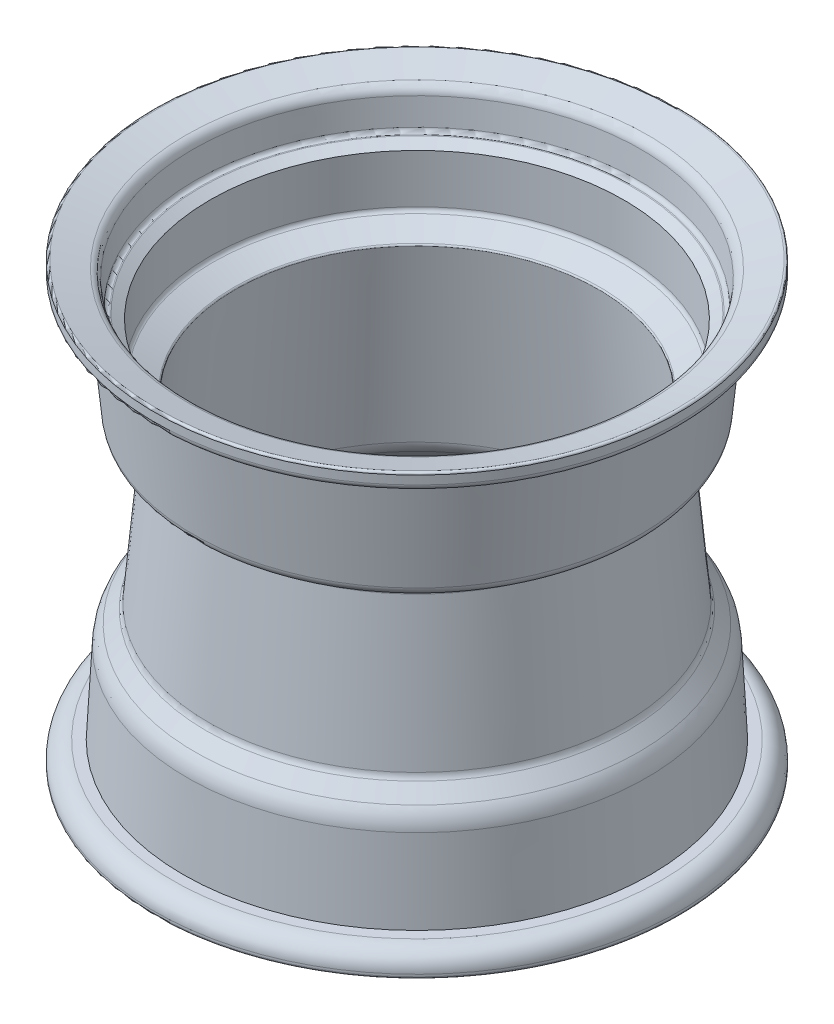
ISO-10303-21;
HEADER;
FILE_DESCRIPTION(('STEP AP214'),'2;1');
FILE_NAME('part.step','',(''),(''),'','','');
FILE_SCHEMA(('AUTOMOTIVE_DESIGN { 1 0 10303 214 1 1 1 1 }'));
ENDSEC;
DATA;
#1=APPLICATION_CONTEXT('core data for automotive mechanical design processes');
#2=APPLICATION_PROTOCOL_DEFINITION('international standard','automotive_design',2000,#1);
#3=PRODUCT_CONTEXT('',#1,'mechanical');
#4=PRODUCT('Part','Part','',(#3));
#5=PRODUCT_RELATED_PRODUCT_CATEGORY('part','',(#4));
#6=PRODUCT_DEFINITION_FORMATION('','',#4);
#7=PRODUCT_DEFINITION_CONTEXT('part definition',#1,'design');
#8=PRODUCT_DEFINITION('design','',#6,#7);
#9=PRODUCT_DEFINITION_SHAPE('','',#8);
#10=(LENGTH_UNIT() NAMED_UNIT(*) SI_UNIT(.MILLI.,.METRE.));
#11=(NAMED_UNIT(*) PLANE_ANGLE_UNIT() SI_UNIT($,.RADIAN.));
#12=(NAMED_UNIT(*) SI_UNIT($,.STERADIAN.) SOLID_ANGLE_UNIT());
#13=UNCERTAINTY_MEASURE_WITH_UNIT(LENGTH_MEASURE(1.E-05),#10,'distance_accuracy_value','');
#14=(GEOMETRIC_REPRESENTATION_CONTEXT(3) GLOBAL_UNCERTAINTY_ASSIGNED_CONTEXT((#13)) GLOBAL_UNIT_ASSIGNED_CONTEXT((#10,
#11,#12)) REPRESENTATION_CONTEXT('',''));
#15=CARTESIAN_POINT('',(0.,0.,0.));
#16=DIRECTION('',(0.,0.,1.));
#17=DIRECTION('',(1.,0.,0.));
#18=AXIS2_PLACEMENT_3D('',#15,#16,#17);
#19=CARTESIAN_POINT('',(1.50740531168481E-09,68.8072227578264,0.));
#20=DIRECTION('',(0.,1.,0.));
#21=DIRECTION('',(-1.,0.,0.));
#22=AXIS2_PLACEMENT_3D('',#19,#20,#21);
#23=TOROIDAL_SURFACE('',#22,173.191199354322,1.88128649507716);
#24=CARTESIAN_POINT('',(1.50738340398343E-09,70.4559709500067,0.));
#25=DIRECTION('',(0.,1.,0.));
#26=DIRECTION('',(-1.,0.,0.));
#27=AXIS2_PLACEMENT_3D('',#24,#25,#26);
#28=CIRCLE('',#27,172.285181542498);
#29=CARTESIAN_POINT('',(-172.285181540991,70.455970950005,0.));
#30=VERTEX_POINT('',#29);
#31=EDGE_CURVE('E10',#30,#30,#28,.T.);
#32=ORIENTED_EDGE('',*,*,#31,.T.);
#33=EDGE_LOOP('',(#32));
#34=FACE_BOUND('',#33,.T.);
#35=CARTESIAN_POINT('',(1.50739990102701E-09,68.8253299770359,0.));
#36=DIRECTION('',(0.,1.,0.));
#37=DIRECTION('',(-1.,0.,0.));
#38=AXIS2_PLACEMENT_3D('',#35,#36,#37);
#39=CIRCLE('',#38,171.310000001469);
#40=CARTESIAN_POINT('',(-171.309999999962,68.8253299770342,0.));
#41=VERTEX_POINT('',#40);
#42=EDGE_CURVE('E157',#41,#41,#39,.T.);
#43=ORIENTED_EDGE('',*,*,#42,.F.);
#44=EDGE_LOOP('',(#43));
#45=FACE_BOUND('',#44,.T.);
#46=ADVANCED_FACE('F36',(#34,#45),#23,.T.);
#47=CARTESIAN_POINT('',(1.50738340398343E-09,70.4559709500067,0.));
#48=DIRECTION('',(0.,1.,0.));
#49=DIRECTION('',(-1.,0.,0.));
#50=AXIS2_PLACEMENT_3D('',#47,#48,#49);
#51=CONICAL_SURFACE('',#50,172.285181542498,1.11221949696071);
#52=CARTESIAN_POINT('',(1.50728239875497E-09,80.4397758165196,0.));
#53=DIRECTION('',(0.,1.,0.));
#54=DIRECTION('',(-1.,0.,0.));
#55=AXIS2_PLACEMENT_3D('',#52,#53,#54);
#56=CIRCLE('',#55,192.508515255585);
#57=CARTESIAN_POINT('',(-192.508515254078,80.4397758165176,0.));
#58=VERTEX_POINT('',#57);
#59=EDGE_CURVE('E42',#58,#58,#56,.T.);
#60=ORIENTED_EDGE('',*,*,#59,.T.);
#61=EDGE_LOOP('',(#60));
#62=FACE_BOUND('',#61,.T.);
#63=ORIENTED_EDGE('',*,*,#31,.F.);
#64=EDGE_LOOP('',(#63));
#65=FACE_BOUND('',#64,.T.);
#66=ADVANCED_FACE('F165',(#62,#65),#51,.F.);
#67=CARTESIAN_POINT('',(1.50723877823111E-09,84.336060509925,0.));
#68=DIRECTION('',(0.,1.,0.));
#69=DIRECTION('',(-1.,0.,0.));
#70=AXIS2_PLACEMENT_3D('',#67,#68,#69);
#71=TOROIDAL_SURFACE('',#70,190.585007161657,4.3452178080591);
#72=CARTESIAN_POINT('',(1.50724298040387E-09,84.336060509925,0.));
#73=DIRECTION('',(0.,1.,0.));
#74=DIRECTION('',(-1.,0.,0.));
#75=AXIS2_PLACEMENT_3D('',#72,#73,#74);
#76=CIRCLE('',#75,194.930224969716);
#77=CARTESIAN_POINT('',(-194.930224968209,84.3360605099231,0.));
#78=VERTEX_POINT('',#77);
#79=EDGE_CURVE('E46',#78,#78,#76,.T.);
#80=ORIENTED_EDGE('',*,*,#79,.T.);
#81=EDGE_LOOP('',(#80));
#82=FACE_BOUND('',#81,.T.);
#83=ORIENTED_EDGE('',*,*,#59,.F.);
#84=EDGE_LOOP('',(#83));
#85=FACE_BOUND('',#84,.T.);
#86=ADVANCED_FACE('F169',(#82,#85),#71,.F.);
#87=CARTESIAN_POINT('',(1.50582631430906E-09,224.365622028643,0.));
#88=DIRECTION('',(0.,1.,0.));
#89=DIRECTION('',(-1.,0.,0.));
#90=AXIS2_PLACEMENT_3D('',#87,#88,#89);
#91=CYLINDRICAL_SURFACE('',#90,194.930224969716);
#92=CARTESIAN_POINT('',(1.50677802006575E-09,130.294803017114,0.));
#93=DIRECTION('',(0.,1.,0.));
#94=DIRECTION('',(-1.,0.,0.));
#95=AXIS2_PLACEMENT_3D('',#92,#93,#94);
#96=CIRCLE('',#95,194.930224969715);
#97=CARTESIAN_POINT('',(-194.930224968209,130.294803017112,0.));
#98=VERTEX_POINT('',#97);
#99=EDGE_CURVE('E50',#98,#98,#96,.T.);
#100=ORIENTED_EDGE('',*,*,#99,.T.);
#101=EDGE_LOOP('',(#100));
#102=FACE_BOUND('',#101,.T.);
#103=ORIENTED_EDGE('',*,*,#79,.F.);
#104=EDGE_LOOP('',(#103));
#105=FACE_BOUND('',#104,.T.);
#106=ADVANCED_FACE('F173',(#102,#105),#91,.F.);
#107=CARTESIAN_POINT('',(1.50677802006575E-09,130.294803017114,0.));
#108=DIRECTION('',(0.,1.,0.));
#109=DIRECTION('',(-1.,0.,0.));
#110=AXIS2_PLACEMENT_3D('',#107,#108,#109);
#111=CONICAL_SURFACE('',#110,194.930224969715,1.01087031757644);
#112=CARTESIAN_POINT('',(1.50672112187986E-09,135.918872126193,0.));
#113=DIRECTION('',(0.,1.,0.));
#114=DIRECTION('',(-1.,0.,0.));
#115=AXIS2_PLACEMENT_3D('',#112,#113,#114);
#116=CIRCLE('',#115,203.902229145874);
#117=CARTESIAN_POINT('',(-203.902229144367,135.918872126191,0.));
#118=VERTEX_POINT('',#117);
#119=EDGE_CURVE('E55',#118,#118,#116,.T.);
#120=ORIENTED_EDGE('',*,*,#119,.T.);
#121=EDGE_LOOP('',(#120));
#122=FACE_BOUND('',#121,.T.);
#123=ORIENTED_EDGE('',*,*,#99,.F.);
#124=EDGE_LOOP('',(#123));
#125=FACE_BOUND('',#124,.T.);
#126=ADVANCED_FACE('F180',(#122,#125),#111,.F.);
#127=CARTESIAN_POINT('',(1.50673917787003E-09,134.560560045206,0.));
#128=DIRECTION('',(0.,1.,0.));
#129=DIRECTION('',(-1.,0.,0.));
#130=AXIS2_PLACEMENT_3D('',#127,#128,#129);
#131=TOROIDAL_SURFACE('',#130,204.753682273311,1.60311700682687);
#132=CARTESIAN_POINT('',(1.50671864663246E-09,136.163536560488,0.));
#133=DIRECTION('',(0.,1.,0.));
#134=DIRECTION('',(-1.,0.,0.));
#135=AXIS2_PLACEMENT_3D('',#132,#133,#134);
#136=CIRCLE('',#135,204.774905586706);
#137=CARTESIAN_POINT('',(-204.7749055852,136.163536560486,0.));
#138=VERTEX_POINT('',#137);
#139=EDGE_CURVE('E58',#138,#138,#136,.T.);
#140=ORIENTED_EDGE('',*,*,#139,.T.);
#141=EDGE_LOOP('',(#140));
#142=FACE_BOUND('',#141,.T.);
#143=ORIENTED_EDGE('',*,*,#119,.F.);
#144=EDGE_LOOP('',(#143));
#145=FACE_BOUND('',#144,.T.);
#146=ADVANCED_FACE('F184',(#142,#145),#131,.T.);
#147=CARTESIAN_POINT('',(1.5066836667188E-09,139.925779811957,0.));
#148=DIRECTION('',(0.,1.,0.));
#149=DIRECTION('',(-1.,0.,0.));
#150=AXIS2_PLACEMENT_3D('',#147,#148,#149);
#151=TOROIDAL_SURFACE('',#150,204.824717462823,3.76257299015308);
#152=CARTESIAN_POINT('',(1.50668420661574E-09,139.567740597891,0.));
#153=DIRECTION('',(0.,1.,0.));
#154=DIRECTION('',(-1.,0.,0.));
#155=AXIS2_PLACEMENT_3D('',#152,#153,#154);
#156=CIRCLE('',#155,208.570216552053);
#157=CARTESIAN_POINT('',(-208.570216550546,139.567740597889,0.));
#158=VERTEX_POINT('',#157);
#159=EDGE_CURVE('E61',#158,#158,#156,.T.);
#160=ORIENTED_EDGE('',*,*,#159,.T.);
#161=EDGE_LOOP('',(#160));
#162=FACE_BOUND('',#161,.T.);
#163=ORIENTED_EDGE('',*,*,#139,.F.);
#164=EDGE_LOOP('',(#163));
#165=FACE_BOUND('',#164,.T.);
#166=ADVANCED_FACE('F188',(#162,#165),#151,.F.);
#167=CARTESIAN_POINT('',(1.50668420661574E-09,139.567740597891,0.));
#168=DIRECTION('',(0.,1.,0.));
#169=DIRECTION('',(-1.,0.,0.));
#170=AXIS2_PLACEMENT_3D('',#167,#168,#169);
#171=CONICAL_SURFACE('',#170,208.570216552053,0.0953022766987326);
#172=CARTESIAN_POINT('',(1.50644019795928E-09,163.686638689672,0.));
#173=DIRECTION('',(0.,1.,0.));
#174=DIRECTION('',(-1.,0.,0.));
#175=AXIS2_PLACEMENT_3D('',#172,#173,#174);
#176=CIRCLE('',#175,210.875786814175);
#177=CARTESIAN_POINT('',(-210.875786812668,163.68663868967,0.));
#178=VERTEX_POINT('',#177);
#179=EDGE_CURVE('E64',#178,#178,#176,.T.);
#180=ORIENTED_EDGE('',*,*,#179,.T.);
#181=EDGE_LOOP('',(#180));
#182=FACE_BOUND('',#181,.T.);
#183=ORIENTED_EDGE('',*,*,#159,.F.);
#184=EDGE_LOOP('',(#183));
#185=FACE_BOUND('',#184,.T.);
#186=ADVANCED_FACE('F192',(#182,#185),#171,.F.);
#187=CARTESIAN_POINT('',(1.50643386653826E-09,162.791540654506,0.));
#188=DIRECTION('',(0.,1.,0.));
#189=DIRECTION('',(-1.,0.,0.));
#190=AXIS2_PLACEMENT_3D('',#187,#188,#189);
#191=TOROIDAL_SURFACE('',#190,220.239534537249,9.40643247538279);
#192=CARTESIAN_POINT('',(1.50635776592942E-09,171.834586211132,0.));
#193=DIRECTION('',(0.,1.,0.));
#194=DIRECTION('',(-1.,0.,0.));
#195=AXIS2_PLACEMENT_3D('',#192,#193,#194);
#196=CIRCLE('',#195,217.650268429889);
#197=CARTESIAN_POINT('',(-217.650268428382,171.83458621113,0.));
#198=VERTEX_POINT('',#197);
#199=EDGE_CURVE('E67',#198,#198,#196,.T.);
#200=ORIENTED_EDGE('',*,*,#199,.T.);
#201=EDGE_LOOP('',(#200));
#202=FACE_BOUND('',#201,.T.);
#203=ORIENTED_EDGE('',*,*,#179,.F.);
#204=EDGE_LOOP('',(#203));
#205=FACE_BOUND('',#204,.T.);
#206=ADVANCED_FACE('F196',(#202,#205),#191,.T.);
#207=CARTESIAN_POINT('',(1.50635776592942E-09,171.834586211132,0.));
#208=DIRECTION('',(0.,1.,0.));
#209=DIRECTION('',(-1.,0.,0.));
#210=AXIS2_PLACEMENT_3D('',#207,#208,#209);
#211=CONICAL_SURFACE('',#210,217.650268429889,1.29193049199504);
#212=CARTESIAN_POINT('',(1.50627949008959E-09,179.571717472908,0.));
#213=DIRECTION('',(0.,1.,0.));
#214=DIRECTION('',(-1.,0.,0.));
#215=AXIS2_PLACEMENT_3D('',#212,#213,#214);
#216=CIRCLE('',#215,244.672299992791);
#217=CARTESIAN_POINT('',(-244.672299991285,179.571717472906,0.));
#218=VERTEX_POINT('',#217);
#219=EDGE_CURVE('E70',#218,#218,#216,.T.);
#220=ORIENTED_EDGE('',*,*,#219,.T.);
#221=EDGE_LOOP('',(#220));
#222=FACE_BOUND('',#221,.T.);
#223=ORIENTED_EDGE('',*,*,#199,.F.);
#224=EDGE_LOOP('',(#223));
#225=FACE_BOUND('',#224,.T.);
#226=ADVANCED_FACE('F200',(#222,#225),#211,.F.);
#227=CARTESIAN_POINT('',(1.50629508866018E-09,177.763108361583,0.));
#228=DIRECTION('',(0.,1.,0.));
#229=DIRECTION('',(-1.,0.,0.));
#230=AXIS2_PLACEMENT_3D('',#227,#228,#229);
#231=TOROIDAL_SURFACE('',#230,245.190153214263,1.88128649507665);
#232=CARTESIAN_POINT('',(1.50629778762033E-09,177.763108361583,0.));
#233=DIRECTION('',(0.,1.,0.));
#234=DIRECTION('',(-1.,0.,0.));
#235=AXIS2_PLACEMENT_3D('',#232,#233,#234);
#236=CIRCLE('',#235,247.07143970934);
#237=CARTESIAN_POINT('',(-247.071439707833,177.763108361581,0.));
#238=VERTEX_POINT('',#237);
#239=EDGE_CURVE('E73',#238,#238,#236,.T.);
#240=ORIENTED_EDGE('',*,*,#239,.T.);
#241=EDGE_LOOP('',(#240));
#242=FACE_BOUND('',#241,.T.);
#243=ORIENTED_EDGE('',*,*,#219,.F.);
#244=EDGE_LOOP('',(#243));
#245=FACE_BOUND('',#244,.T.);
#246=ADVANCED_FACE('F204',(#242,#245),#231,.T.);
#247=CARTESIAN_POINT('',(1.50582631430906E-09,224.365622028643,0.));
#248=DIRECTION('',(0.,1.,0.));
#249=DIRECTION('',(-1.,0.,0.));
#250=AXIS2_PLACEMENT_3D('',#247,#248,#249);
#251=CYLINDRICAL_SURFACE('',#250,247.07143970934);
#252=CARTESIAN_POINT('',(1.5063793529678E-09,169.70082757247,0.));
#253=DIRECTION('',(0.,1.,0.));
#254=DIRECTION('',(-1.,0.,0.));
#255=AXIS2_PLACEMENT_3D('',#252,#253,#254);
#256=CIRCLE('',#255,247.07143970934);
#257=CARTESIAN_POINT('',(-247.071439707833,169.700827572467,0.));
#258=VERTEX_POINT('',#257);
#259=EDGE_CURVE('E76',#258,#258,#256,.T.);
#260=ORIENTED_EDGE('',*,*,#259,.T.);
#261=EDGE_LOOP('',(#260));
#262=FACE_BOUND('',#261,.T.);
#263=ORIENTED_EDGE('',*,*,#239,.F.);
#264=EDGE_LOOP('',(#263));
#265=FACE_BOUND('',#264,.T.);
#266=ADVANCED_FACE('F208',(#262,#265),#251,.T.);
#267=CARTESIAN_POINT('',(1.50637835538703E-09,169.700827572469,0.));
#268=DIRECTION('',(0.,1.,0.));
#269=DIRECTION('',(-1.,0.,0.));
#270=AXIS2_PLACEMENT_3D('',#267,#268,#269);
#271=TOROIDAL_SURFACE('',#270,241.42758022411,5.64385948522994);
#272=CARTESIAN_POINT('',(1.50643476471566E-09,164.223684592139,0.));
#273=DIRECTION('',(0.,1.,0.));
#274=DIRECTION('',(-1.,0.,0.));
#275=AXIS2_PLACEMENT_3D('',#272,#273,#274);
#276=CIRCLE('',#275,242.789216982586);
#277=CARTESIAN_POINT('',(-242.78921698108,164.223684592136,0.));
#278=VERTEX_POINT('',#277);
#279=EDGE_CURVE('E79',#278,#278,#276,.T.);
#280=ORIENTED_EDGE('',*,*,#279,.T.);
#281=EDGE_LOOP('',(#280));
#282=FACE_BOUND('',#281,.T.);
#283=ORIENTED_EDGE('',*,*,#259,.F.);
#284=EDGE_LOOP('',(#283));
#285=FACE_BOUND('',#284,.T.);
#286=ADVANCED_FACE('F212',(#282,#285),#271,.T.);
#287=CARTESIAN_POINT('',(1.50643476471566E-09,164.223684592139,0.));
#288=DIRECTION('',(0.,1.,0.));
#289=DIRECTION('',(-1.,0.,0.));
#290=AXIS2_PLACEMENT_3D('',#287,#288,#289);
#291=CONICAL_SURFACE('',#290,242.789216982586,1.32713247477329);
#292=CARTESIAN_POINT('',(1.50647625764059E-09,160.122339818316,0.));
#293=DIRECTION('',(0.,1.,0.));
#294=DIRECTION('',(-1.,0.,0.));
#295=AXIS2_PLACEMENT_3D('',#292,#293,#294);
#296=CIRCLE('',#295,226.291680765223);
#297=CARTESIAN_POINT('',(-226.291680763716,160.122339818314,0.));
#298=VERTEX_POINT('',#297);
#299=EDGE_CURVE('E82',#298,#298,#296,.T.);
#300=ORIENTED_EDGE('',*,*,#299,.T.);
#301=EDGE_LOOP('',(#300));
#302=FACE_BOUND('',#301,.T.);
#303=ORIENTED_EDGE('',*,*,#279,.F.);
#304=EDGE_LOOP('',(#303));
#305=FACE_BOUND('',#304,.T.);
#306=ADVANCED_FACE('F216',(#302,#305),#291,.T.);
#307=CARTESIAN_POINT('',(1.50657264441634E-09,150.993768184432,0.));
#308=DIRECTION('',(0.,1.,0.));
#309=DIRECTION('',(-1.,0.,0.));
#310=AXIS2_PLACEMENT_3D('',#307,#308,#309);
#311=TOROIDAL_SURFACE('',#310,228.561075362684,9.4064324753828);
#312=CARTESIAN_POINT('',(1.50655955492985E-09,151.888866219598,0.));
#313=DIRECTION('',(0.,1.,0.));
#314=DIRECTION('',(-1.,0.,0.));
#315=AXIS2_PLACEMENT_3D('',#312,#313,#314);
#316=CIRCLE('',#315,219.197327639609);
#317=CARTESIAN_POINT('',(-219.197327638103,151.888866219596,0.));
#318=VERTEX_POINT('',#317);
#319=EDGE_CURVE('E85',#318,#318,#316,.T.);
#320=ORIENTED_EDGE('',*,*,#319,.T.);
#321=EDGE_LOOP('',(#320));
#322=FACE_BOUND('',#321,.T.);
#323=ORIENTED_EDGE('',*,*,#299,.F.);
#324=EDGE_LOOP('',(#323));
#325=FACE_BOUND('',#324,.T.);
#326=ADVANCED_FACE('F220',(#322,#325),#311,.F.);
#327=CARTESIAN_POINT('',(1.50655955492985E-09,151.888866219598,0.));
#328=DIRECTION('',(0.,1.,0.));
#329=DIRECTION('',(-1.,0.,0.));
#330=AXIS2_PLACEMENT_3D('',#327,#328,#329);
#331=CONICAL_SURFACE('',#330,219.197327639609,0.0953022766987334);
#332=CARTESIAN_POINT('',(1.50749278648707E-09,59.6441190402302,0.));
#333=DIRECTION('',(0.,1.,0.));
#334=DIRECTION('',(-1.,0.,0.));
#335=AXIS2_PLACEMENT_3D('',#332,#333,#334);
#336=CIRCLE('',#335,210.379480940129);
#337=CARTESIAN_POINT('',(-210.379480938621,59.644119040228,0.));
#338=VERTEX_POINT('',#337);
#339=EDGE_CURVE('E88',#338,#338,#336,.T.);
#340=ORIENTED_EDGE('',*,*,#339,.T.);
#341=EDGE_LOOP('',(#340));
#342=FACE_BOUND('',#341,.T.);
#343=ORIENTED_EDGE('',*,*,#319,.F.);
#344=EDGE_LOOP('',(#343));
#345=FACE_BOUND('',#344,.T.);
#346=ADVANCED_FACE('F224',(#342,#345),#331,.T.);
#347=CARTESIAN_POINT('',(1.50748857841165E-09,60.5392170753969,0.));
#348=DIRECTION('',(0.,1.,0.));
#349=DIRECTION('',(-1.,0.,0.));
#350=AXIS2_PLACEMENT_3D('',#347,#348,#349);
#351=TOROIDAL_SURFACE('',#350,201.015733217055,9.40643247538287);
#352=CARTESIAN_POINT('',(1.50757116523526E-09,51.8968158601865,0.));
#353=DIRECTION('',(0.,1.,0.));
#354=DIRECTION('',(-1.,0.,0.));
#355=AXIS2_PLACEMENT_3D('',#352,#353,#354);
#356=CIRCLE('',#355,204.729205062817);
#357=CARTESIAN_POINT('',(-204.729205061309,51.8968158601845,0.));
#358=VERTEX_POINT('',#357);
#359=EDGE_CURVE('E91',#358,#358,#356,.T.);
#360=ORIENTED_EDGE('',*,*,#359,.T.);
#361=EDGE_LOOP('',(#360));
#362=FACE_BOUND('',#361,.T.);
#363=ORIENTED_EDGE('',*,*,#339,.F.);
#364=EDGE_LOOP('',(#363));
#365=FACE_BOUND('',#364,.T.);
#366=ADVANCED_FACE('F228',(#362,#365),#351,.T.);
#367=CARTESIAN_POINT('',(1.50757116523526E-09,51.8968158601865,0.));
#368=DIRECTION('',(0.,1.,0.));
#369=DIRECTION('',(-1.,0.,0.));
#370=AXIS2_PLACEMENT_3D('',#367,#368,#369);
#371=CONICAL_SURFACE('',#370,204.729205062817,1.16496788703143);
#372=CARTESIAN_POINT('',(1.50763793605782E-09,45.2968915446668,0.));
#373=DIRECTION('',(0.,1.,0.));
#374=DIRECTION('',(-1.,0.,0.));
#375=AXIS2_PLACEMENT_3D('',#372,#373,#374);
#376=CIRCLE('',#375,189.369133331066);
#377=CARTESIAN_POINT('',(-189.369133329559,45.2968915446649,0.));
#378=VERTEX_POINT('',#377);
#379=EDGE_CURVE('E94',#378,#378,#376,.T.);
#380=ORIENTED_EDGE('',*,*,#379,.T.);
#381=EDGE_LOOP('',(#380));
#382=FACE_BOUND('',#381,.T.);
#383=ORIENTED_EDGE('',*,*,#359,.F.);
#384=EDGE_LOOP('',(#383));
#385=FACE_BOUND('',#384,.T.);
#386=ADVANCED_FACE('F232',(#382,#385),#371,.T.);
#387=CARTESIAN_POINT('',(1.50771062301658E-09,36.6544903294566,0.));
#388=DIRECTION('',(0.,1.,0.));
#389=DIRECTION('',(-1.,0.,0.));
#390=AXIS2_PLACEMENT_3D('',#387,#388,#389);
#391=TOROIDAL_SURFACE('',#390,193.082605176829,9.40643247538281);
#392=CARTESIAN_POINT('',(1.50773386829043E-09,35.8145240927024,0.));
#393=DIRECTION('',(0.,1.,0.));
#394=DIRECTION('',(-1.,0.,0.));
#395=AXIS2_PLACEMENT_3D('',#392,#393,#394);
#396=CIRCLE('',#395,183.713750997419);
#397=CARTESIAN_POINT('',(-183.713750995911,35.8145240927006,0.));
#398=VERTEX_POINT('',#397);
#399=EDGE_CURVE('E97',#398,#398,#396,.T.);
#400=ORIENTED_EDGE('',*,*,#399,.T.);
#401=EDGE_LOOP('',(#400));
#402=FACE_BOUND('',#401,.T.);
#403=ORIENTED_EDGE('',*,*,#379,.F.);
#404=EDGE_LOOP('',(#403));
#405=FACE_BOUND('',#404,.T.);
#406=ADVANCED_FACE('F236',(#402,#405),#391,.F.);
#407=CARTESIAN_POINT('',(1.50773386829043E-09,35.8145240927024,0.));
#408=DIRECTION('',(0.,-1.,0.));
#409=DIRECTION('',(1.,0.,0.));
#410=AXIS2_PLACEMENT_3D('',#407,#408,#409);
#411=CONICAL_SURFACE('',#410,183.713750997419,0.0894161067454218);
#412=CARTESIAN_POINT('',(1.50911840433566E-09,-101.039160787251,0.));
#413=DIRECTION('',(0.,1.,0.));
#414=DIRECTION('',(-1.,0.,0.));
#415=AXIS2_PLACEMENT_3D('',#412,#413,#414);
#416=CIRCLE('',#415,195.983391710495);
#417=CARTESIAN_POINT('',(-195.983391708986,-101.039160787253,0.));
#418=VERTEX_POINT('',#417);
#419=EDGE_CURVE('E100',#418,#418,#416,.T.);
#420=ORIENTED_EDGE('',*,*,#419,.T.);
#421=EDGE_LOOP('',(#420));
#422=FACE_BOUND('',#421,.T.);
#423=ORIENTED_EDGE('',*,*,#399,.F.);
#424=EDGE_LOOP('',(#423));
#425=FACE_BOUND('',#424,.T.);
#426=ADVANCED_FACE('F240',(#422,#425),#411,.T.);
#427=CARTESIAN_POINT('',(1.50909840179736E-09,-100.199194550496,0.));
#428=DIRECTION('',(0.,1.,0.));
#429=DIRECTION('',(-1.,0.,0.));
#430=AXIS2_PLACEMENT_3D('',#427,#428,#429);
#431=TOROIDAL_SURFACE('',#430,205.352245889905,9.4064324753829);
#432=CARTESIAN_POINT('',(1.50917367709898E-09,-106.502565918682,0.));
#433=DIRECTION('',(0.,1.,0.));
#434=DIRECTION('',(-1.,0.,0.));
#435=AXIS2_PLACEMENT_3D('',#432,#433,#434);
#436=CIRCLE('',#435,198.370234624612);
#437=CARTESIAN_POINT('',(-198.370234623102,-106.502565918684,0.));
#438=VERTEX_POINT('',#437);
#439=EDGE_CURVE('E103',#438,#438,#436,.T.);
#440=ORIENTED_EDGE('',*,*,#439,.T.);
#441=EDGE_LOOP('',(#440));
#442=FACE_BOUND('',#441,.T.);
#443=ORIENTED_EDGE('',*,*,#419,.F.);
#444=EDGE_LOOP('',(#443));
#445=FACE_BOUND('',#444,.T.);
#446=ADVANCED_FACE('F244',(#442,#445),#431,.F.);
#447=CARTESIAN_POINT('',(1.50917367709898E-09,-106.502565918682,0.));
#448=DIRECTION('',(0.,-1.,0.));
#449=DIRECTION('',(1.,0.,0.));
#450=AXIS2_PLACEMENT_3D('',#447,#448,#449);
#451=CONICAL_SURFACE('',#450,198.370234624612,0.734360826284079);
#452=CARTESIAN_POINT('',(1.50929417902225E-09,-118.41351059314,0.));
#453=DIRECTION('',(0.,1.,0.));
#454=DIRECTION('',(-1.,0.,0.));
#455=AXIS2_PLACEMENT_3D('',#452,#453,#454);
#456=CIRCLE('',#455,209.123455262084);
#457=CARTESIAN_POINT('',(-209.123455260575,-118.413510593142,0.));
#458=VERTEX_POINT('',#457);
#459=EDGE_CURVE('E106',#458,#458,#456,.T.);
#460=ORIENTED_EDGE('',*,*,#459,.T.);
#461=EDGE_LOOP('',(#460));
#462=FACE_BOUND('',#461,.T.);
#463=ORIENTED_EDGE('',*,*,#439,.F.);
#464=EDGE_LOOP('',(#463));
#465=FACE_BOUND('',#464,.T.);
#466=ADVANCED_FACE('F248',(#462,#465),#451,.T.);
#467=CARTESIAN_POINT('',(1.50948697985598E-09,-137.323624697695,0.));
#468=DIRECTION('',(0.,1.,0.));
#469=DIRECTION('',(-1.,0.,0.));
#470=AXIS2_PLACEMENT_3D('',#467,#468,#469);
#471=TOROIDAL_SURFACE('',#470,188.177421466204,28.2192974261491);
#472=CARTESIAN_POINT('',(1.50947046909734E-09,-135.838803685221,0.));
#473=DIRECTION('',(0.,1.,0.));
#474=DIRECTION('',(-1.,0.,0.));
#475=AXIS2_PLACEMENT_3D('',#472,#473,#474);
#476=CIRCLE('',#475,216.357628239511);
#477=CARTESIAN_POINT('',(-216.357628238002,-135.838803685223,0.));
#478=VERTEX_POINT('',#477);
#479=EDGE_CURVE('E109',#478,#478,#476,.T.);
#480=ORIENTED_EDGE('',*,*,#479,.T.);
#481=EDGE_LOOP('',(#480));
#482=FACE_BOUND('',#481,.T.);
#483=ORIENTED_EDGE('',*,*,#459,.F.);
#484=EDGE_LOOP('',(#483));
#485=FACE_BOUND('',#484,.T.);
#486=ADVANCED_FACE('F252',(#482,#485),#471,.T.);
#487=CARTESIAN_POINT('',(1.50947046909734E-09,-135.838803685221,0.));
#488=DIRECTION('',(0.,-1.,0.));
#489=DIRECTION('',(1.,0.,0.));
#490=AXIS2_PLACEMENT_3D('',#487,#488,#489);
#491=CONICAL_SURFACE('',#490,216.357628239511,0.0526415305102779);
#492=CARTESIAN_POINT('',(1.51024851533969E-09,-212.744345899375,0.));
#493=DIRECTION('',(0.,1.,0.));
#494=DIRECTION('',(-1.,0.,0.));
#495=AXIS2_PLACEMENT_3D('',#492,#493,#494);
#496=CIRCLE('',#495,220.40979740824);
#497=CARTESIAN_POINT('',(-220.40979740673,-212.744345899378,0.));
#498=VERTEX_POINT('',#497);
#499=EDGE_CURVE('E112',#498,#498,#496,.T.);
#500=ORIENTED_EDGE('',*,*,#499,.T.);
#501=EDGE_LOOP('',(#500));
#502=FACE_BOUND('',#501,.T.);
#503=ORIENTED_EDGE('',*,*,#479,.F.);
#504=EDGE_LOOP('',(#503));
#505=FACE_BOUND('',#504,.T.);
#506=ADVANCED_FACE('F256',(#502,#505),#491,.T.);
#507=CARTESIAN_POINT('',(-220.40979740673,-212.744345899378,0.));
#508=DIRECTION('',(0.,1.,0.));
#509=DIRECTION('',(-1.,0.,0.));
#510=AXIS2_PLACEMENT_3D('',#507,#508,#509);
#511=PLANE('',#510);
#512=CARTESIAN_POINT('',(1.51024851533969E-09,-212.744345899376,0.));
#513=DIRECTION('',(0.,1.,0.));
#514=DIRECTION('',(-1.,0.,0.));
#515=AXIS2_PLACEMENT_3D('',#512,#513,#514);
#516=CIRCLE('',#515,230.139861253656);
#517=CARTESIAN_POINT('',(-230.139861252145,-212.744345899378,0.));
#518=VERTEX_POINT('',#517);
#519=EDGE_CURVE('E115',#518,#518,#516,.T.);
#520=ORIENTED_EDGE('',*,*,#519,.T.);
#521=EDGE_LOOP('',(#520));
#522=FACE_BOUND('',#521,.T.);
#523=ORIENTED_EDGE('',*,*,#499,.F.);
#524=EDGE_LOOP('',(#523));
#525=FACE_BOUND('',#524,.T.);
#526=ADVANCED_FACE('F260',(#522,#525),#511,.T.);
#527=CARTESIAN_POINT('',(1.51040291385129E-09,-229.675924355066,0.));
#528=DIRECTION('',(0.,1.,0.));
#529=DIRECTION('',(-1.,0.,0.));
#530=AXIS2_PLACEMENT_3D('',#527,#528,#529);
#531=TOROIDAL_SURFACE('',#530,230.139861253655,16.9315784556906);
#532=CARTESIAN_POINT('',(1.51041981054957E-09,-229.675924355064,0.));
#533=DIRECTION('',(0.,1.,0.));
#534=DIRECTION('',(-1.,0.,0.));
#535=AXIS2_PLACEMENT_3D('',#532,#533,#534);
#536=CIRCLE('',#535,247.071439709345);
#537=CARTESIAN_POINT('',(-247.071439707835,-229.675924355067,0.));
#538=VERTEX_POINT('',#537);
#539=EDGE_CURVE('E118',#538,#538,#536,.T.);
#540=ORIENTED_EDGE('',*,*,#539,.T.);
#541=EDGE_LOOP('',(#540));
#542=FACE_BOUND('',#541,.T.);
#543=ORIENTED_EDGE('',*,*,#519,.F.);
#544=EDGE_LOOP('',(#543));
#545=FACE_BOUND('',#544,.T.);
#546=ADVANCED_FACE('F264',(#542,#545),#531,.T.);
#547=CARTESIAN_POINT('',(1.50582631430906E-09,224.365622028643,0.));
#548=DIRECTION('',(0.,1.,0.));
#549=DIRECTION('',(-1.,0.,0.));
#550=AXIS2_PLACEMENT_3D('',#547,#548,#549);
#551=CYLINDRICAL_SURFACE('',#550,247.071439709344);
#552=CARTESIAN_POINT('',(1.51044072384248E-09,-231.743087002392,0.));
#553=DIRECTION('',(0.,1.,0.));
#554=DIRECTION('',(-1.,0.,0.));
#555=AXIS2_PLACEMENT_3D('',#552,#553,#554);
#556=CIRCLE('',#555,247.071439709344);
#557=CARTESIAN_POINT('',(-247.071439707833,-231.743087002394,0.));
#558=VERTEX_POINT('',#557);
#559=EDGE_CURVE('E121',#558,#558,#556,.T.);
#560=ORIENTED_EDGE('',*,*,#559,.T.);
#561=EDGE_LOOP('',(#560));
#562=FACE_BOUND('',#561,.T.);
#563=ORIENTED_EDGE('',*,*,#539,.F.);
#564=EDGE_LOOP('',(#563));
#565=FACE_BOUND('',#564,.T.);
#566=ADVANCED_FACE('F268',(#562,#565),#551,.T.);
#567=CARTESIAN_POINT('',(1.51043066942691E-09,-231.743087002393,0.));
#568=DIRECTION('',(0.,1.,0.));
#569=DIRECTION('',(-1.,0.,0.));
#570=AXIS2_PLACEMENT_3D('',#567,#568,#569);
#571=TOROIDAL_SURFACE('',#570,245.190153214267,1.88128649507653);
#572=CARTESIAN_POINT('',(1.51045975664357E-09,-233.624373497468,0.));
#573=DIRECTION('',(0.,1.,0.));
#574=DIRECTION('',(-1.,0.,0.));
#575=AXIS2_PLACEMENT_3D('',#572,#573,#574);
#576=CIRCLE('',#575,245.190153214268);
#577=CARTESIAN_POINT('',(-245.190153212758,-233.624373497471,0.));
#578=VERTEX_POINT('',#577);
#579=EDGE_CURVE('E124',#578,#578,#576,.T.);
#580=ORIENTED_EDGE('',*,*,#579,.T.);
#581=EDGE_LOOP('',(#580));
#582=FACE_BOUND('',#581,.T.);
#583=ORIENTED_EDGE('',*,*,#559,.F.);
#584=EDGE_LOOP('',(#583));
#585=FACE_BOUND('',#584,.T.);
#586=ADVANCED_FACE('F272',(#582,#585),#571,.T.);
#587=CARTESIAN_POINT('',(-239.546293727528,-233.624373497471,0.));
#588=DIRECTION('',(0.,-1.,0.));
#589=DIRECTION('',(1.,0.,0.));
#590=AXIS2_PLACEMENT_3D('',#587,#588,#589);
#591=PLANE('',#590);
#592=CARTESIAN_POINT('',(1.51045975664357E-09,-233.624373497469,0.));
#593=DIRECTION('',(0.,1.,0.));
#594=DIRECTION('',(-1.,0.,0.));
#595=AXIS2_PLACEMENT_3D('',#592,#593,#594);
#596=CIRCLE('',#595,239.546293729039);
#597=CARTESIAN_POINT('',(-239.546293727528,-233.624373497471,0.));
#598=VERTEX_POINT('',#597);
#599=EDGE_CURVE('E127',#598,#598,#596,.T.);
#600=ORIENTED_EDGE('',*,*,#599,.T.);
#601=EDGE_LOOP('',(#600));
#602=FACE_BOUND('',#601,.T.);
#603=ORIENTED_EDGE('',*,*,#579,.F.);
#604=EDGE_LOOP('',(#603));
#605=FACE_BOUND('',#604,.T.);
#606=ADVANCED_FACE('F276',(#602,#605),#591,.T.);
#607=CARTESIAN_POINT('',(1.51043066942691E-09,-231.743087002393,0.));
#608=DIRECTION('',(0.,1.,0.));
#609=DIRECTION('',(-1.,0.,0.));
#610=AXIS2_PLACEMENT_3D('',#607,#608,#609);
#611=TOROIDAL_SURFACE('',#610,239.546293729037,1.8812864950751);
#612=CARTESIAN_POINT('',(1.51044072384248E-09,-231.743087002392,0.));
#613=DIRECTION('',(0.,1.,0.));
#614=DIRECTION('',(-1.,0.,0.));
#615=AXIS2_PLACEMENT_3D('',#612,#613,#614);
#616=CIRCLE('',#615,237.665007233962);
#617=CARTESIAN_POINT('',(-237.665007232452,-231.743087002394,0.));
#618=VERTEX_POINT('',#617);
#619=EDGE_CURVE('E130',#618,#618,#616,.T.);
#620=ORIENTED_EDGE('',*,*,#619,.T.);
#621=EDGE_LOOP('',(#620));
#622=FACE_BOUND('',#621,.T.);
#623=ORIENTED_EDGE('',*,*,#599,.F.);
#624=EDGE_LOOP('',(#623));
#625=FACE_BOUND('',#624,.T.);
#626=ADVANCED_FACE('F280',(#622,#625),#611,.T.);
#627=CARTESIAN_POINT('',(1.50582631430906E-09,224.365622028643,0.));
#628=DIRECTION('',(0.,1.,0.));
#629=DIRECTION('',(-1.,0.,0.));
#630=AXIS2_PLACEMENT_3D('',#627,#628,#629);
#631=CYLINDRICAL_SURFACE('',#630,237.665007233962);
#632=CARTESIAN_POINT('',(1.51041981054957E-09,-229.675924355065,0.));
#633=DIRECTION('',(0.,1.,0.));
#634=DIRECTION('',(-1.,0.,0.));
#635=AXIS2_PLACEMENT_3D('',#632,#633,#634);
#636=CIRCLE('',#635,237.665007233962);
#637=CARTESIAN_POINT('',(-237.665007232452,-229.675924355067,0.));
#638=VERTEX_POINT('',#637);
#639=EDGE_CURVE('E133',#638,#638,#636,.T.);
#640=ORIENTED_EDGE('',*,*,#639,.T.);
#641=EDGE_LOOP('',(#640));
#642=FACE_BOUND('',#641,.T.);
#643=ORIENTED_EDGE('',*,*,#619,.F.);
#644=EDGE_LOOP('',(#643));
#645=FACE_BOUND('',#644,.T.);
#646=ADVANCED_FACE('F284',(#642,#645),#631,.F.);
#647=CARTESIAN_POINT('',(1.51040291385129E-09,-229.675924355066,0.));
#648=DIRECTION('',(0.,1.,0.));
#649=DIRECTION('',(-1.,0.,0.));
#650=AXIS2_PLACEMENT_3D('',#647,#648,#649);
#651=TOROIDAL_SURFACE('',#650,230.139861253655,7.52514598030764);
#652=CARTESIAN_POINT('',(1.51034367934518E-09,-222.150778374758,0.));
#653=DIRECTION('',(0.,1.,0.));
#654=DIRECTION('',(-1.,0.,0.));
#655=AXIS2_PLACEMENT_3D('',#652,#653,#654);
#656=CIRCLE('',#655,230.139861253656);
#657=CARTESIAN_POINT('',(-230.139861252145,-222.150778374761,0.));
#658=VERTEX_POINT('',#657);
#659=EDGE_CURVE('E136',#658,#658,#656,.T.);
#660=ORIENTED_EDGE('',*,*,#659,.T.);
#661=EDGE_LOOP('',(#660));
#662=FACE_BOUND('',#661,.T.);
#663=ORIENTED_EDGE('',*,*,#639,.F.);
#664=EDGE_LOOP('',(#663));
#665=FACE_BOUND('',#664,.T.);
#666=ADVANCED_FACE('F288',(#662,#665),#651,.F.);
#667=CARTESIAN_POINT('',(-218.625026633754,-222.150778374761,0.));
#668=DIRECTION('',(0.,-1.,0.));
#669=DIRECTION('',(1.,0.,0.));
#670=AXIS2_PLACEMENT_3D('',#667,#668,#669);
#671=PLANE('',#670);
#672=CARTESIAN_POINT('',(1.51034367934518E-09,-222.150778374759,0.));
#673=DIRECTION('',(0.,1.,0.));
#674=DIRECTION('',(-1.,0.,0.));
#675=AXIS2_PLACEMENT_3D('',#672,#673,#674);
#676=CIRCLE('',#675,218.625026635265);
#677=CARTESIAN_POINT('',(-218.625026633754,-222.150778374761,0.));
#678=VERTEX_POINT('',#677);
#679=EDGE_CURVE('E139',#678,#678,#676,.T.);
#680=ORIENTED_EDGE('',*,*,#679,.T.);
#681=EDGE_LOOP('',(#680));
#682=FACE_BOUND('',#681,.T.);
#683=ORIENTED_EDGE('',*,*,#659,.F.);
#684=EDGE_LOOP('',(#683));
#685=FACE_BOUND('',#684,.T.);
#686=ADVANCED_FACE('F292',(#682,#685),#671,.T.);
#687=CARTESIAN_POINT('',(1.51026413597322E-09,-214.625632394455,0.));
#688=DIRECTION('',(0.,1.,0.));
#689=DIRECTION('',(-1.,0.,0.));
#690=AXIS2_PLACEMENT_3D('',#687,#688,#689);
#691=TOROIDAL_SURFACE('',#690,218.625026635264,7.52514598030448);
#692=CARTESIAN_POINT('',(1.51027155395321E-09,-215.02158466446,0.));
#693=DIRECTION('',(0.,1.,0.));
#694=DIRECTION('',(-1.,0.,0.));
#695=AXIS2_PLACEMENT_3D('',#692,#693,#694);
#696=CIRCLE('',#695,211.11030482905);
#697=CARTESIAN_POINT('',(-211.11030482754,-215.021584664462,0.));
#698=VERTEX_POINT('',#697);
#699=EDGE_CURVE('E142',#698,#698,#696,.T.);
#700=ORIENTED_EDGE('',*,*,#699,.T.);
#701=EDGE_LOOP('',(#700));
#702=FACE_BOUND('',#701,.T.);
#703=ORIENTED_EDGE('',*,*,#679,.F.);
#704=EDGE_LOOP('',(#703));
#705=FACE_BOUND('',#704,.T.);
#706=ADVANCED_FACE('F296',(#702,#705),#691,.T.);
#707=CARTESIAN_POINT('',(1.51027155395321E-09,-215.02158466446,0.));
#708=DIRECTION('',(0.,-1.,0.));
#709=DIRECTION('',(1.,0.,0.));
#710=AXIS2_PLACEMENT_3D('',#707,#708,#709);
#711=CONICAL_SURFACE('',#710,211.11030482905,0.0526415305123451);
#712=CARTESIAN_POINT('',(1.50947547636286E-09,-136.33374402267,0.));
#713=DIRECTION('',(0.,1.,0.));
#714=DIRECTION('',(-1.,0.,0.));
#715=AXIS2_PLACEMENT_3D('',#712,#713,#714);
#716=CIRCLE('',#715,206.96422598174);
#717=CARTESIAN_POINT('',(-206.964225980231,-136.333744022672,0.));
#718=VERTEX_POINT('',#717);
#719=EDGE_CURVE('E145',#718,#718,#716,.T.);
#720=ORIENTED_EDGE('',*,*,#719,.T.);
#721=EDGE_LOOP('',(#720));
#722=FACE_BOUND('',#721,.T.);
#723=ORIENTED_EDGE('',*,*,#699,.F.);
#724=EDGE_LOOP('',(#723));
#725=FACE_BOUND('',#724,.T.);
#726=ADVANCED_FACE('F300',(#722,#725),#711,.F.);
#727=CARTESIAN_POINT('',(1.50948697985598E-09,-137.323624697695,0.));
#728=DIRECTION('',(0.,1.,0.));
#729=DIRECTION('',(-1.,0.,0.));
#730=AXIS2_PLACEMENT_3D('',#727,#728,#729);
#731=TOROIDAL_SURFACE('',#730,188.177421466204,18.8128649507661);
#732=CARTESIAN_POINT('',(1.50935794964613E-09,-124.716881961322,0.));
#733=DIRECTION('',(0.,1.,0.));
#734=DIRECTION('',(-1.,0.,0.));
#735=AXIS2_PLACEMENT_3D('',#732,#733,#734);
#736=CIRCLE('',#735,202.14144399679);
#737=CARTESIAN_POINT('',(-202.14144399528,-124.716881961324,0.));
#738=VERTEX_POINT('',#737);
#739=EDGE_CURVE('E148',#738,#738,#736,.T.);
#740=ORIENTED_EDGE('',*,*,#739,.T.);
#741=EDGE_LOOP('',(#740));
#742=FACE_BOUND('',#741,.T.);
#743=ORIENTED_EDGE('',*,*,#719,.F.);
#744=EDGE_LOOP('',(#743));
#745=FACE_BOUND('',#744,.T.);
#746=ADVANCED_FACE('F304',(#742,#745),#731,.F.);
#747=CARTESIAN_POINT('',(1.50935794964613E-09,-124.716881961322,0.));
#748=DIRECTION('',(0.,-1.,0.));
#749=DIRECTION('',(1.,0.,0.));
#750=AXIS2_PLACEMENT_3D('',#747,#748,#749);
#751=CONICAL_SURFACE('',#750,202.14144399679,0.734360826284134);
#752=CARTESIAN_POINT('',(1.50923744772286E-09,-112.805937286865,0.));
#753=DIRECTION('',(0.,1.,0.));
#754=DIRECTION('',(-1.,0.,0.));
#755=AXIS2_PLACEMENT_3D('',#752,#753,#754);
#756=CIRCLE('',#755,191.388223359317);
#757=CARTESIAN_POINT('',(-191.388223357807,-112.805937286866,0.));
#758=VERTEX_POINT('',#757);
#759=EDGE_CURVE('E151',#758,#758,#756,.T.);
#760=ORIENTED_EDGE('',*,*,#759,.T.);
#761=EDGE_LOOP('',(#760));
#762=FACE_BOUND('',#761,.T.);
#763=ORIENTED_EDGE('',*,*,#739,.F.);
#764=EDGE_LOOP('',(#763));
#765=FACE_BOUND('',#764,.T.);
#766=ADVANCED_FACE('F308',(#762,#765),#751,.F.);
#767=CARTESIAN_POINT('',(1.50909840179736E-09,-100.199194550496,0.));
#768=DIRECTION('',(0.,1.,0.));
#769=DIRECTION('',(-1.,0.,0.));
#770=AXIS2_PLACEMENT_3D('',#767,#768,#769);
#771=TOROIDAL_SURFACE('',#770,205.352245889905,18.8128649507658);
#772=CARTESIAN_POINT('',(1.50912690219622E-09,-101.879127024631,0.));
#773=DIRECTION('',(0.,1.,0.));
#774=DIRECTION('',(-1.,0.,0.));
#775=AXIS2_PLACEMENT_3D('',#772,#773,#774);
#776=CIRCLE('',#775,186.61453753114);
#777=CARTESIAN_POINT('',(-186.614537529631,-101.879127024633,0.));
#778=VERTEX_POINT('',#777);
#779=EDGE_CURVE('E154',#778,#778,#776,.T.);
#780=ORIENTED_EDGE('',*,*,#779,.T.);
#781=EDGE_LOOP('',(#780));
#782=FACE_BOUND('',#781,.T.);
#783=ORIENTED_EDGE('',*,*,#759,.F.);
#784=EDGE_LOOP('',(#783));
#785=FACE_BOUND('',#784,.T.);
#786=ADVANCED_FACE('F312',(#782,#785),#771,.T.);
#787=CARTESIAN_POINT('',(1.50912690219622E-09,-101.879127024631,0.));
#788=DIRECTION('',(0.,-1.,0.));
#789=DIRECTION('',(1.,0.,0.));
#790=AXIS2_PLACEMENT_3D('',#787,#788,#789);
#791=CONICAL_SURFACE('',#790,186.61453753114,0.0894161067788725);
#792=ORIENTED_EDGE('',*,*,#42,.T.);
#793=EDGE_LOOP('',(#792));
#794=FACE_BOUND('',#793,.T.);
#795=ORIENTED_EDGE('',*,*,#779,.F.);
#796=EDGE_LOOP('',(#795));
#797=FACE_BOUND('',#796,.T.);
#798=ADVANCED_FACE('F161',(#794,#797),#791,.F.);
#799=CLOSED_SHELL('',(#46,#66,#86,#106,#126,#146,#166,#186,#206,#226,#246,#266,#286,#306,#326,
#346,#366,#386,#406,#426,#446,#466,#486,#506,#526,#546,#566,#586,#606,#626,#646,#666,#686,#706,
#726,#746,#766,#786,#798));
#800=MANIFOLD_SOLID_BREP('B2',#799);
#801=ADVANCED_BREP_SHAPE_REPRESENTATION('',(#18,#800),#14);
#802=SHAPE_DEFINITION_REPRESENTATION(#9,#801);
ENDSEC;
END-ISO-10303-21;
